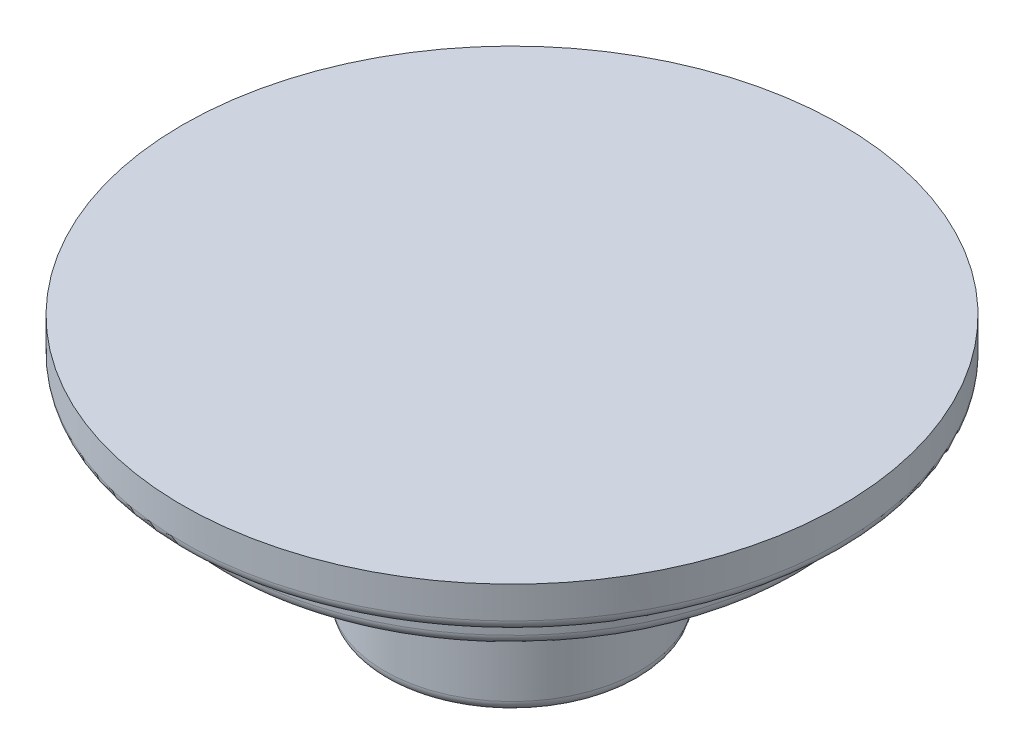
ISO-10303-21;
HEADER;
FILE_DESCRIPTION(('STEP AP214'),'2;1');
FILE_NAME('part.step','',(''),(''),'','','');
FILE_SCHEMA(('AUTOMOTIVE_DESIGN { 1 0 10303 214 1 1 1 1 }'));
ENDSEC;
DATA;
#1=APPLICATION_CONTEXT('core data for automotive mechanical design processes');
#2=APPLICATION_PROTOCOL_DEFINITION('international standard','automotive_design',2000,#1);
#3=PRODUCT_CONTEXT('',#1,'mechanical');
#4=PRODUCT('Part','Part','',(#3));
#5=PRODUCT_RELATED_PRODUCT_CATEGORY('part','',(#4));
#6=PRODUCT_DEFINITION_FORMATION('','',#4);
#7=PRODUCT_DEFINITION_CONTEXT('part definition',#1,'design');
#8=PRODUCT_DEFINITION('design','',#6,#7);
#9=PRODUCT_DEFINITION_SHAPE('','',#8);
#10=(LENGTH_UNIT() NAMED_UNIT(*) SI_UNIT(.MILLI.,.METRE.));
#11=(NAMED_UNIT(*) PLANE_ANGLE_UNIT() SI_UNIT($,.RADIAN.));
#12=(NAMED_UNIT(*) SI_UNIT($,.STERADIAN.) SOLID_ANGLE_UNIT());
#13=UNCERTAINTY_MEASURE_WITH_UNIT(LENGTH_MEASURE(1.E-05),#10,'distance_accuracy_value','');
#14=(GEOMETRIC_REPRESENTATION_CONTEXT(3) GLOBAL_UNCERTAINTY_ASSIGNED_CONTEXT((#13)) GLOBAL_UNIT_ASSIGNED_CONTEXT((#10,
#11,#12)) REPRESENTATION_CONTEXT('',''));
#15=CARTESIAN_POINT('',(0.,0.,0.));
#16=DIRECTION('',(0.,0.,1.));
#17=DIRECTION('',(1.,0.,0.));
#18=AXIS2_PLACEMENT_3D('',#15,#16,#17);
#19=CARTESIAN_POINT('',(0.,-36.5125,0.));
#20=DIRECTION('',(0.,1.,0.));
#21=DIRECTION('',(-1.,0.,0.));
#22=AXIS2_PLACEMENT_3D('',#19,#20,#21);
#23=PLANE('',#22);
#24=CARTESIAN_POINT('',(0.,-36.5125,0.));
#25=DIRECTION('',(0.,1.,0.));
#26=DIRECTION('',(-1.,0.,0.));
#27=AXIS2_PLACEMENT_3D('',#24,#25,#26);
#28=CIRCLE('',#27,49.2125);
#29=CARTESIAN_POINT('',(-49.2125,-36.5125,0.));
#30=VERTEX_POINT('',#29);
#31=EDGE_CURVE('E73',#30,#30,#28,.T.);
#32=ORIENTED_EDGE('',*,*,#31,.T.);
#33=EDGE_LOOP('',(#32));
#34=FACE_BOUND('',#33,.T.);
#35=ADVANCED_FACE('F24',(#34),#23,.T.);
#36=CARTESIAN_POINT('',(0.,0.,0.));
#37=DIRECTION('',(0.,1.,0.));
#38=DIRECTION('',(-1.,0.,0.));
#39=AXIS2_PLACEMENT_3D('',#36,#37,#38);
#40=CYLINDRICAL_SURFACE('',#39,49.2125);
#41=CARTESIAN_POINT('',(0.,-41.275,0.));
#42=DIRECTION('',(0.,-1.,0.));
#43=DIRECTION('',(1.,0.,0.));
#44=AXIS2_PLACEMENT_3D('',#41,#42,#43);
#45=CIRCLE('',#44,49.2125);
#46=CARTESIAN_POINT('',(49.2125,-41.275,0.));
#47=VERTEX_POINT('',#46);
#48=EDGE_CURVE('E34',#47,#47,#45,.F.);
#49=ORIENTED_EDGE('',*,*,#48,.T.);
#50=EDGE_LOOP('',(#49));
#51=FACE_BOUND('',#50,.T.);
#52=ORIENTED_EDGE('',*,*,#31,.F.);
#53=EDGE_LOOP('',(#52));
#54=FACE_BOUND('',#53,.T.);
#55=ADVANCED_FACE('F78',(#51,#54),#40,.T.);
#56=CARTESIAN_POINT('',(-49.2125,-42.8625,0.));
#57=DIRECTION('',(0.,-1.,0.));
#58=DIRECTION('',(1.,0.,0.));
#59=AXIS2_PLACEMENT_3D('',#56,#57,#58);
#60=PLANE('',#59);
#61=CARTESIAN_POINT('',(0.,-42.8625,0.));
#62=DIRECTION('',(0.,-1.,0.));
#63=DIRECTION('',(1.,0.,0.));
#64=AXIS2_PLACEMENT_3D('',#61,#62,#63);
#65=CIRCLE('',#64,47.625);
#66=CARTESIAN_POINT('',(47.625,-42.8625,0.));
#67=VERTEX_POINT('',#66);
#68=EDGE_CURVE('E10',#67,#67,#65,.T.);
#69=ORIENTED_EDGE('',*,*,#68,.T.);
#70=EDGE_LOOP('',(#69));
#71=FACE_BOUND('',#70,.T.);
#72=CARTESIAN_POINT('',(0.,-42.8625,0.));
#73=DIRECTION('',(0.,-1.,0.));
#74=DIRECTION('',(1.,0.,0.));
#75=AXIS2_PLACEMENT_3D('',#72,#73,#74);
#76=CIRCLE('',#75,44.45);
#77=CARTESIAN_POINT('',(44.45,-42.8625,0.));
#78=VERTEX_POINT('',#77);
#79=EDGE_CURVE('E30',#78,#78,#76,.F.);
#80=ORIENTED_EDGE('',*,*,#79,.T.);
#81=EDGE_LOOP('',(#80));
#82=FACE_BOUND('',#81,.T.);
#83=ADVANCED_FACE('F80',(#71,#82),#60,.T.);
#84=CARTESIAN_POINT('',(0.,0.,0.));
#85=DIRECTION('',(0.,1.,0.));
#86=DIRECTION('',(-1.,0.,0.));
#87=AXIS2_PLACEMENT_3D('',#84,#85,#86);
#88=CYLINDRICAL_SURFACE('',#87,42.8625);
#89=CARTESIAN_POINT('',(0.,-47.625,0.));
#90=DIRECTION('',(0.,-1.,0.));
#91=DIRECTION('',(1.,0.,0.));
#92=AXIS2_PLACEMENT_3D('',#89,#90,#91);
#93=CIRCLE('',#92,42.8625);
#94=CARTESIAN_POINT('',(42.8625,-47.625,0.));
#95=VERTEX_POINT('',#94);
#96=EDGE_CURVE('E46',#95,#95,#93,.F.);
#97=ORIENTED_EDGE('',*,*,#96,.T.);
#98=EDGE_LOOP('',(#97));
#99=FACE_BOUND('',#98,.T.);
#100=CARTESIAN_POINT('',(0.,-44.45,0.));
#101=DIRECTION('',(0.,-1.,0.));
#102=DIRECTION('',(1.,0.,0.));
#103=AXIS2_PLACEMENT_3D('',#100,#101,#102);
#104=CIRCLE('',#103,42.8625);
#105=CARTESIAN_POINT('',(42.8625,-44.45,0.));
#106=VERTEX_POINT('',#105);
#107=EDGE_CURVE('E49',#106,#106,#104,.T.);
#108=ORIENTED_EDGE('',*,*,#107,.T.);
#109=EDGE_LOOP('',(#108));
#110=FACE_BOUND('',#109,.T.);
#111=ADVANCED_FACE('F86',(#99,#110),#88,.T.);
#112=CARTESIAN_POINT('',(-42.8625,-49.2125,0.));
#113=DIRECTION('',(0.,-1.,0.));
#114=DIRECTION('',(1.,0.,0.));
#115=AXIS2_PLACEMENT_3D('',#112,#113,#114);
#116=PLANE('',#115);
#117=CARTESIAN_POINT('',(0.,-49.2125,0.));
#118=DIRECTION('',(0.,-1.,0.));
#119=DIRECTION('',(1.,0.,0.));
#120=AXIS2_PLACEMENT_3D('',#117,#118,#119);
#121=CIRCLE('',#120,41.275);
#122=CARTESIAN_POINT('',(41.275,-49.2125,0.));
#123=VERTEX_POINT('',#122);
#124=EDGE_CURVE('E38',#123,#123,#121,.T.);
#125=ORIENTED_EDGE('',*,*,#124,.T.);
#126=EDGE_LOOP('',(#125));
#127=FACE_BOUND('',#126,.T.);
#128=CARTESIAN_POINT('',(0.,-49.2125,0.));
#129=DIRECTION('',(0.,-1.,0.));
#130=DIRECTION('',(1.,0.,0.));
#131=AXIS2_PLACEMENT_3D('',#128,#129,#130);
#132=CIRCLE('',#131,20.6375);
#133=CARTESIAN_POINT('',(20.6375,-49.2125,0.));
#134=VERTEX_POINT('',#133);
#135=EDGE_CURVE('E43',#134,#134,#132,.F.);
#136=ORIENTED_EDGE('',*,*,#135,.T.);
#137=EDGE_LOOP('',(#136));
#138=FACE_BOUND('',#137,.T.);
#139=ADVANCED_FACE('F91',(#127,#138),#116,.T.);
#140=CARTESIAN_POINT('',(0.,0.,0.));
#141=DIRECTION('',(0.,1.,0.));
#142=DIRECTION('',(-1.,0.,0.));
#143=AXIS2_PLACEMENT_3D('',#140,#141,#142);
#144=CYLINDRICAL_SURFACE('',#143,19.05);
#145=CARTESIAN_POINT('',(0.,-73.025,0.));
#146=DIRECTION('',(0.,-1.,0.));
#147=DIRECTION('',(1.,0.,0.));
#148=AXIS2_PLACEMENT_3D('',#145,#146,#147);
#149=CIRCLE('',#148,19.05);
#150=CARTESIAN_POINT('',(19.05,-73.025,0.));
#151=VERTEX_POINT('',#150);
#152=EDGE_CURVE('E58',#151,#151,#149,.F.);
#153=ORIENTED_EDGE('',*,*,#152,.T.);
#154=EDGE_LOOP('',(#153));
#155=FACE_BOUND('',#154,.T.);
#156=CARTESIAN_POINT('',(0.,-50.8,0.));
#157=DIRECTION('',(0.,-1.,0.));
#158=DIRECTION('',(1.,0.,0.));
#159=AXIS2_PLACEMENT_3D('',#156,#157,#158);
#160=CIRCLE('',#159,19.05);
#161=CARTESIAN_POINT('',(19.05,-50.8,0.));
#162=VERTEX_POINT('',#161);
#163=EDGE_CURVE('E61',#162,#162,#160,.T.);
#164=ORIENTED_EDGE('',*,*,#163,.T.);
#165=EDGE_LOOP('',(#164));
#166=FACE_BOUND('',#165,.T.);
#167=ADVANCED_FACE('F95',(#155,#166),#144,.T.);
#168=CARTESIAN_POINT('',(-19.05,-74.6125,0.));
#169=DIRECTION('',(0.,-1.,0.));
#170=DIRECTION('',(1.,0.,0.));
#171=AXIS2_PLACEMENT_3D('',#168,#169,#170);
#172=PLANE('',#171);
#173=CARTESIAN_POINT('',(0.,-74.6125,0.));
#174=DIRECTION('',(0.,-1.,0.));
#175=DIRECTION('',(1.,0.,0.));
#176=AXIS2_PLACEMENT_3D('',#173,#174,#175);
#177=CIRCLE('',#176,17.4625);
#178=CARTESIAN_POINT('',(17.4625,-74.6125,0.));
#179=VERTEX_POINT('',#178);
#180=EDGE_CURVE('E52',#179,#179,#177,.T.);
#181=ORIENTED_EDGE('',*,*,#180,.T.);
#182=EDGE_LOOP('',(#181));
#183=FACE_BOUND('',#182,.T.);
#184=CARTESIAN_POINT('',(0.,-74.6125,0.));
#185=DIRECTION('',(0.,-1.,0.));
#186=DIRECTION('',(1.,0.,0.));
#187=AXIS2_PLACEMENT_3D('',#184,#185,#186);
#188=CIRCLE('',#187,14.2875);
#189=CARTESIAN_POINT('',(14.2875,-74.6125,0.));
#190=VERTEX_POINT('',#189);
#191=EDGE_CURVE('E55',#190,#190,#188,.F.);
#192=ORIENTED_EDGE('',*,*,#191,.T.);
#193=EDGE_LOOP('',(#192));
#194=FACE_BOUND('',#193,.T.);
#195=ADVANCED_FACE('F99',(#183,#194),#172,.T.);
#196=CARTESIAN_POINT('',(0.,0.,0.));
#197=DIRECTION('',(0.,1.,0.));
#198=DIRECTION('',(-1.,0.,0.));
#199=AXIS2_PLACEMENT_3D('',#196,#197,#198);
#200=CYLINDRICAL_SURFACE('',#199,12.7);
#201=CARTESIAN_POINT('',(0.,-53.975,0.));
#202=DIRECTION('',(0.,-1.,0.));
#203=DIRECTION('',(1.,0.,0.));
#204=AXIS2_PLACEMENT_3D('',#201,#202,#203);
#205=CIRCLE('',#204,12.7);
#206=CARTESIAN_POINT('',(12.7,-53.975,0.));
#207=VERTEX_POINT('',#206);
#208=EDGE_CURVE('E67',#207,#207,#205,.F.);
#209=ORIENTED_EDGE('',*,*,#208,.T.);
#210=EDGE_LOOP('',(#209));
#211=FACE_BOUND('',#210,.T.);
#212=CARTESIAN_POINT('',(0.,-73.025,0.));
#213=DIRECTION('',(0.,-1.,0.));
#214=DIRECTION('',(1.,0.,0.));
#215=AXIS2_PLACEMENT_3D('',#212,#213,#214);
#216=CIRCLE('',#215,12.7);
#217=CARTESIAN_POINT('',(12.7,-73.025,0.));
#218=VERTEX_POINT('',#217);
#219=EDGE_CURVE('E70',#218,#218,#216,.T.);
#220=ORIENTED_EDGE('',*,*,#219,.T.);
#221=EDGE_LOOP('',(#220));
#222=FACE_BOUND('',#221,.T.);
#223=ADVANCED_FACE('F103',(#211,#222),#200,.F.);
#224=CARTESIAN_POINT('',(-12.7,-52.3875,0.));
#225=DIRECTION('',(0.,-1.,0.));
#226=DIRECTION('',(1.,0.,0.));
#227=AXIS2_PLACEMENT_3D('',#224,#225,#226);
#228=PLANE('',#227);
#229=CARTESIAN_POINT('',(0.,-52.3875,0.));
#230=DIRECTION('',(0.,-1.,0.));
#231=DIRECTION('',(1.,0.,0.));
#232=AXIS2_PLACEMENT_3D('',#229,#230,#231);
#233=CIRCLE('',#232,11.1125);
#234=CARTESIAN_POINT('',(11.1125,-52.3875,0.));
#235=VERTEX_POINT('',#234);
#236=EDGE_CURVE('E64',#235,#235,#233,.T.);
#237=ORIENTED_EDGE('',*,*,#236,.T.);
#238=EDGE_LOOP('',(#237));
#239=FACE_BOUND('',#238,.T.);
#240=ADVANCED_FACE('F107',(#239),#228,.T.);
#241=CARTESIAN_POINT('',(0.,-53.975,0.));
#242=DIRECTION('',(0.,-1.,0.));
#243=DIRECTION('',(1.,0.,0.));
#244=AXIS2_PLACEMENT_3D('',#241,#242,#243);
#245=TOROIDAL_SURFACE('',#244,11.1125,1.5875);
#246=ORIENTED_EDGE('',*,*,#236,.F.);
#247=EDGE_LOOP('',(#246));
#248=FACE_BOUND('',#247,.T.);
#249=ORIENTED_EDGE('',*,*,#208,.F.);
#250=EDGE_LOOP('',(#249));
#251=FACE_BOUND('',#250,.T.);
#252=ADVANCED_FACE('F111',(#248,#251),#245,.F.);
#253=CARTESIAN_POINT('',(0.,-73.025,0.));
#254=DIRECTION('',(0.,-1.,0.));
#255=DIRECTION('',(1.,0.,0.));
#256=AXIS2_PLACEMENT_3D('',#253,#254,#255);
#257=TOROIDAL_SURFACE('',#256,17.4625,1.5875);
#258=ORIENTED_EDGE('',*,*,#180,.F.);
#259=EDGE_LOOP('',(#258));
#260=FACE_BOUND('',#259,.T.);
#261=ORIENTED_EDGE('',*,*,#152,.F.);
#262=EDGE_LOOP('',(#261));
#263=FACE_BOUND('',#262,.T.);
#264=ADVANCED_FACE('F115',(#260,#263),#257,.T.);
#265=CARTESIAN_POINT('',(0.,-73.025,0.));
#266=DIRECTION('',(0.,-1.,0.));
#267=DIRECTION('',(1.,0.,0.));
#268=AXIS2_PLACEMENT_3D('',#265,#266,#267);
#269=TOROIDAL_SURFACE('',#268,14.2875,1.5875);
#270=ORIENTED_EDGE('',*,*,#219,.F.);
#271=EDGE_LOOP('',(#270));
#272=FACE_BOUND('',#271,.T.);
#273=ORIENTED_EDGE('',*,*,#191,.F.);
#274=EDGE_LOOP('',(#273));
#275=FACE_BOUND('',#274,.T.);
#276=ADVANCED_FACE('F119',(#272,#275),#269,.T.);
#277=CARTESIAN_POINT('',(0.,-47.625,0.));
#278=DIRECTION('',(0.,-1.,0.));
#279=DIRECTION('',(1.,0.,0.));
#280=AXIS2_PLACEMENT_3D('',#277,#278,#279);
#281=TOROIDAL_SURFACE('',#280,41.275,1.5875);
#282=ORIENTED_EDGE('',*,*,#124,.F.);
#283=EDGE_LOOP('',(#282));
#284=FACE_BOUND('',#283,.T.);
#285=ORIENTED_EDGE('',*,*,#96,.F.);
#286=EDGE_LOOP('',(#285));
#287=FACE_BOUND('',#286,.T.);
#288=ADVANCED_FACE('F123',(#284,#287),#281,.T.);
#289=CARTESIAN_POINT('',(0.,-50.8,0.));
#290=DIRECTION('',(0.,-1.,0.));
#291=DIRECTION('',(1.,0.,0.));
#292=AXIS2_PLACEMENT_3D('',#289,#290,#291);
#293=TOROIDAL_SURFACE('',#292,20.6375,1.5875);
#294=ORIENTED_EDGE('',*,*,#163,.F.);
#295=EDGE_LOOP('',(#294));
#296=FACE_BOUND('',#295,.T.);
#297=ORIENTED_EDGE('',*,*,#135,.F.);
#298=EDGE_LOOP('',(#297));
#299=FACE_BOUND('',#298,.T.);
#300=ADVANCED_FACE('F127',(#296,#299),#293,.F.);
#301=CARTESIAN_POINT('',(0.,-41.275,0.));
#302=DIRECTION('',(0.,-1.,0.));
#303=DIRECTION('',(1.,0.,0.));
#304=AXIS2_PLACEMENT_3D('',#301,#302,#303);
#305=TOROIDAL_SURFACE('',#304,47.625,1.5875);
#306=ORIENTED_EDGE('',*,*,#68,.F.);
#307=EDGE_LOOP('',(#306));
#308=FACE_BOUND('',#307,.T.);
#309=ORIENTED_EDGE('',*,*,#48,.F.);
#310=EDGE_LOOP('',(#309));
#311=FACE_BOUND('',#310,.T.);
#312=ADVANCED_FACE('F131',(#308,#311),#305,.T.);
#313=CARTESIAN_POINT('',(0.,-44.45,0.));
#314=DIRECTION('',(0.,-1.,0.));
#315=DIRECTION('',(1.,0.,0.));
#316=AXIS2_PLACEMENT_3D('',#313,#314,#315);
#317=TOROIDAL_SURFACE('',#316,44.45,1.5875);
#318=ORIENTED_EDGE('',*,*,#107,.F.);
#319=EDGE_LOOP('',(#318));
#320=FACE_BOUND('',#319,.T.);
#321=ORIENTED_EDGE('',*,*,#79,.F.);
#322=EDGE_LOOP('',(#321));
#323=FACE_BOUND('',#322,.T.);
#324=ADVANCED_FACE('F135',(#320,#323),#317,.F.);
#325=CLOSED_SHELL('',(#35,#55,#83,#111,#139,#167,#195,#223,#240,#252,#264,#276,#288,#300,#312,#324));
#326=MANIFOLD_SOLID_BREP('B2',#325);
#327=ADVANCED_BREP_SHAPE_REPRESENTATION('',(#18,#326),#14);
#328=SHAPE_DEFINITION_REPRESENTATION(#9,#327);
ENDSEC;
END-ISO-10303-21;
